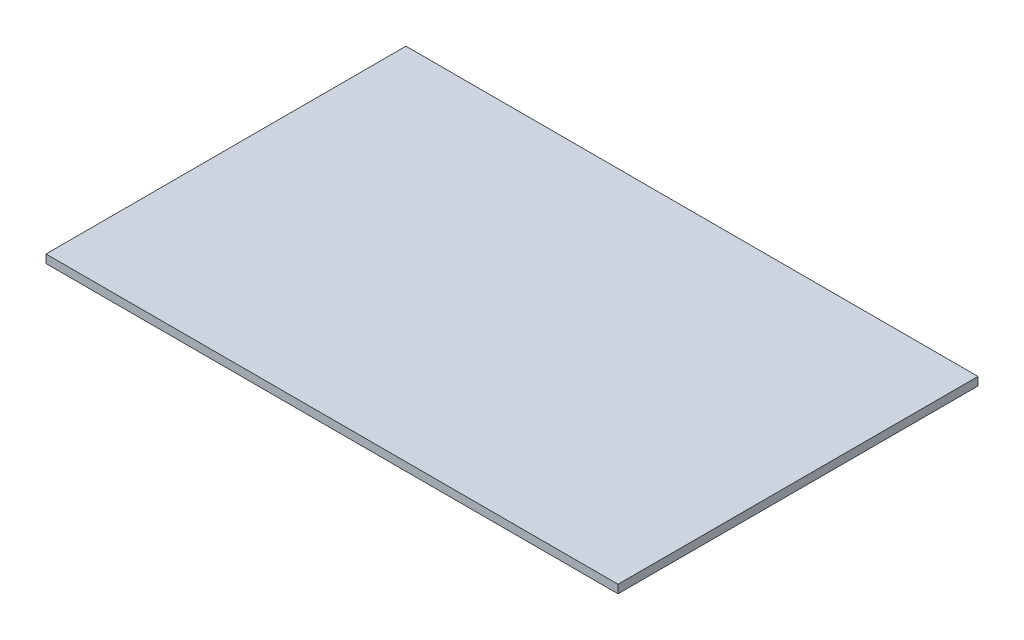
ISO-10303-21;
HEADER;
FILE_DESCRIPTION(('STEP AP214'),'2;1');
FILE_NAME('part.step','',(''),(''),'','','');
FILE_SCHEMA(('AUTOMOTIVE_DESIGN { 1 0 10303 214 1 1 1 1 }'));
ENDSEC;
DATA;
#1=APPLICATION_CONTEXT('core data for automotive mechanical design processes');
#2=APPLICATION_PROTOCOL_DEFINITION('international standard','automotive_design',2000,#1);
#3=PRODUCT_CONTEXT('',#1,'mechanical');
#4=PRODUCT('Part','Part','',(#3));
#5=PRODUCT_RELATED_PRODUCT_CATEGORY('part','',(#4));
#6=PRODUCT_DEFINITION_FORMATION('','',#4);
#7=PRODUCT_DEFINITION_CONTEXT('part definition',#1,'design');
#8=PRODUCT_DEFINITION('design','',#6,#7);
#9=PRODUCT_DEFINITION_SHAPE('','',#8);
#10=(LENGTH_UNIT() NAMED_UNIT(*) SI_UNIT(.MILLI.,.METRE.));
#11=(NAMED_UNIT(*) PLANE_ANGLE_UNIT() SI_UNIT($,.RADIAN.));
#12=(NAMED_UNIT(*) SI_UNIT($,.STERADIAN.) SOLID_ANGLE_UNIT());
#13=UNCERTAINTY_MEASURE_WITH_UNIT(LENGTH_MEASURE(1.E-05),#10,'distance_accuracy_value','');
#14=(GEOMETRIC_REPRESENTATION_CONTEXT(3) GLOBAL_UNCERTAINTY_ASSIGNED_CONTEXT((#13)) GLOBAL_UNIT_ASSIGNED_CONTEXT((#10,
#11,#12)) REPRESENTATION_CONTEXT('',''));
#15=CARTESIAN_POINT('',(0.,0.,0.));
#16=DIRECTION('',(0.,0.,1.));
#17=DIRECTION('',(1.,0.,0.));
#18=AXIS2_PLACEMENT_3D('',#15,#16,#17);
#19=CARTESIAN_POINT('',(206.6,6.,130.));
#20=DIRECTION('',(-1.,0.,0.));
#21=DIRECTION('',(0.,0.,1.));
#22=AXIS2_PLACEMENT_3D('',#19,#20,#21);
#23=PLANE('',#22);
#24=DIRECTION('',(0.,0.,-1.));
#25=VECTOR('',#24,1.);
#26=CARTESIAN_POINT('',(206.6,0.,130.));
#27=LINE('',#26,#25);
#28=CARTESIAN_POINT('',(206.6,0.,130.));
#29=VERTEX_POINT('',#28);
#30=CARTESIAN_POINT('',(206.6,0.,-130.));
#31=VERTEX_POINT('',#30);
#32=EDGE_CURVE('E100',#29,#31,#27,.T.);
#33=ORIENTED_EDGE('',*,*,#32,.T.);
#34=DIRECTION('',(0.,-1.,0.));
#35=VECTOR('',#34,1.);
#36=CARTESIAN_POINT('',(206.6,6.,-130.));
#37=LINE('',#36,#35);
#38=CARTESIAN_POINT('',(206.6,6.,-130.));
#39=VERTEX_POINT('',#38);
#40=EDGE_CURVE('E11',#39,#31,#37,.T.);
#41=ORIENTED_EDGE('',*,*,#40,.F.);
#42=DIRECTION('',(0.,0.,-1.));
#43=VECTOR('',#42,1.);
#44=CARTESIAN_POINT('',(206.6,6.,130.));
#45=LINE('',#44,#43);
#46=CARTESIAN_POINT('',(206.6,6.,130.));
#47=VERTEX_POINT('',#46);
#48=EDGE_CURVE('E88',#47,#39,#45,.T.);
#49=ORIENTED_EDGE('',*,*,#48,.F.);
#50=DIRECTION('',(0.,-1.,0.));
#51=VECTOR('',#50,1.);
#52=CARTESIAN_POINT('',(206.6,6.,130.));
#53=LINE('',#52,#51);
#54=EDGE_CURVE('E96',#47,#29,#53,.T.);
#55=ORIENTED_EDGE('',*,*,#54,.T.);
#56=EDGE_LOOP('',(#33,#41,#49,#55));
#57=FACE_BOUND('',#56,.T.);
#58=ADVANCED_FACE('F37',(#57),#23,.F.);
#59=CARTESIAN_POINT('',(-206.6,6.,-130.));
#60=DIRECTION('',(0.,0.,1.));
#61=DIRECTION('',(1.,0.,0.));
#62=AXIS2_PLACEMENT_3D('',#59,#60,#61);
#63=PLANE('',#62);
#64=DIRECTION('',(-1.,0.,0.));
#65=VECTOR('',#64,1.);
#66=CARTESIAN_POINT('',(-206.6,0.,-130.));
#67=LINE('',#66,#65);
#68=CARTESIAN_POINT('',(-206.6,0.,-130.));
#69=VERTEX_POINT('',#68);
#70=EDGE_CURVE('E92',#31,#69,#67,.T.);
#71=ORIENTED_EDGE('',*,*,#70,.T.);
#72=DIRECTION('',(0.,-1.,0.));
#73=VECTOR('',#72,1.);
#74=CARTESIAN_POINT('',(-206.6,6.,-130.));
#75=LINE('',#74,#73);
#76=CARTESIAN_POINT('',(-206.6,6.,-130.));
#77=VERTEX_POINT('',#76);
#78=EDGE_CURVE('E45',#77,#69,#75,.T.);
#79=ORIENTED_EDGE('',*,*,#78,.F.);
#80=DIRECTION('',(-1.,0.,0.));
#81=VECTOR('',#80,1.);
#82=CARTESIAN_POINT('',(-206.6,6.,-130.));
#83=LINE('',#82,#81);
#84=EDGE_CURVE('E83',#39,#77,#83,.T.);
#85=ORIENTED_EDGE('',*,*,#84,.F.);
#86=ORIENTED_EDGE('',*,*,#40,.T.);
#87=EDGE_LOOP('',(#71,#79,#85,#86));
#88=FACE_BOUND('',#87,.T.);
#89=ADVANCED_FACE('F91',(#88),#63,.F.);
#90=CARTESIAN_POINT('',(-206.6,6.,130.));
#91=DIRECTION('',(1.,0.,0.));
#92=DIRECTION('',(0.,0.,-1.));
#93=AXIS2_PLACEMENT_3D('',#90,#91,#92);
#94=PLANE('',#93);
#95=DIRECTION('',(0.,0.,1.));
#96=VECTOR('',#95,1.);
#97=CARTESIAN_POINT('',(-206.6,0.,130.));
#98=LINE('',#97,#96);
#99=CARTESIAN_POINT('',(-206.6,0.,130.));
#100=VERTEX_POINT('',#99);
#101=EDGE_CURVE('E70',#69,#100,#98,.T.);
#102=ORIENTED_EDGE('',*,*,#101,.T.);
#103=DIRECTION('',(0.,-1.,0.));
#104=VECTOR('',#103,1.);
#105=CARTESIAN_POINT('',(-206.6,6.,130.));
#106=LINE('',#105,#104);
#107=CARTESIAN_POINT('',(-206.6,6.,130.));
#108=VERTEX_POINT('',#107);
#109=EDGE_CURVE('E93',#108,#100,#106,.T.);
#110=ORIENTED_EDGE('',*,*,#109,.F.);
#111=DIRECTION('',(0.,0.,1.));
#112=VECTOR('',#111,1.);
#113=CARTESIAN_POINT('',(-206.6,6.,130.));
#114=LINE('',#113,#112);
#115=EDGE_CURVE('E86',#77,#108,#114,.T.);
#116=ORIENTED_EDGE('',*,*,#115,.F.);
#117=ORIENTED_EDGE('',*,*,#78,.T.);
#118=EDGE_LOOP('',(#102,#110,#116,#117));
#119=FACE_BOUND('',#118,.T.);
#120=ADVANCED_FACE('F94',(#119),#94,.F.);
#121=CARTESIAN_POINT('',(-206.6,6.,130.));
#122=DIRECTION('',(0.,0.,-1.));
#123=DIRECTION('',(-1.,0.,0.));
#124=AXIS2_PLACEMENT_3D('',#121,#122,#123);
#125=PLANE('',#124);
#126=DIRECTION('',(1.,0.,0.));
#127=VECTOR('',#126,1.);
#128=CARTESIAN_POINT('',(-206.6,0.,130.));
#129=LINE('',#128,#127);
#130=EDGE_CURVE('E76',#100,#29,#129,.T.);
#131=ORIENTED_EDGE('',*,*,#130,.T.);
#132=ORIENTED_EDGE('',*,*,#54,.F.);
#133=DIRECTION('',(1.,0.,0.));
#134=VECTOR('',#133,1.);
#135=CARTESIAN_POINT('',(-206.6,6.,130.));
#136=LINE('',#135,#134);
#137=EDGE_CURVE('E53',#108,#47,#136,.T.);
#138=ORIENTED_EDGE('',*,*,#137,.F.);
#139=ORIENTED_EDGE('',*,*,#109,.T.);
#140=EDGE_LOOP('',(#131,#132,#138,#139));
#141=FACE_BOUND('',#140,.T.);
#142=ADVANCED_FACE('F107',(#141),#125,.F.);
#143=CARTESIAN_POINT('',(0.,6.,0.));
#144=DIRECTION('',(0.,-1.,0.));
#145=DIRECTION('',(0.,0.,-1.));
#146=AXIS2_PLACEMENT_3D('',#143,#144,#145);
#147=PLANE('',#146);
#148=ORIENTED_EDGE('',*,*,#48,.T.);
#149=ORIENTED_EDGE('',*,*,#84,.T.);
#150=ORIENTED_EDGE('',*,*,#115,.T.);
#151=ORIENTED_EDGE('',*,*,#137,.T.);
#152=EDGE_LOOP('',(#148,#149,#150,#151));
#153=FACE_BOUND('',#152,.T.);
#154=ADVANCED_FACE('F84',(#153),#147,.F.);
#155=CARTESIAN_POINT('',(0.,0.,0.));
#156=DIRECTION('',(0.,-1.,0.));
#157=DIRECTION('',(0.,0.,-1.));
#158=AXIS2_PLACEMENT_3D('',#155,#156,#157);
#159=PLANE('',#158);
#160=ORIENTED_EDGE('',*,*,#32,.F.);
#161=ORIENTED_EDGE('',*,*,#130,.F.);
#162=ORIENTED_EDGE('',*,*,#101,.F.);
#163=ORIENTED_EDGE('',*,*,#70,.F.);
#164=EDGE_LOOP('',(#160,#161,#162,#163));
#165=FACE_BOUND('',#164,.T.);
#166=ADVANCED_FACE('F110',(#165),#159,.T.);
#167=CLOSED_SHELL('',(#58,#89,#120,#142,#154,#166));
#168=MANIFOLD_SOLID_BREP('B2',#167);
#169=ADVANCED_BREP_SHAPE_REPRESENTATION('',(#18,#168),#14);
#170=SHAPE_DEFINITION_REPRESENTATION(#9,#169);
ENDSEC;
END-ISO-10303-21;
